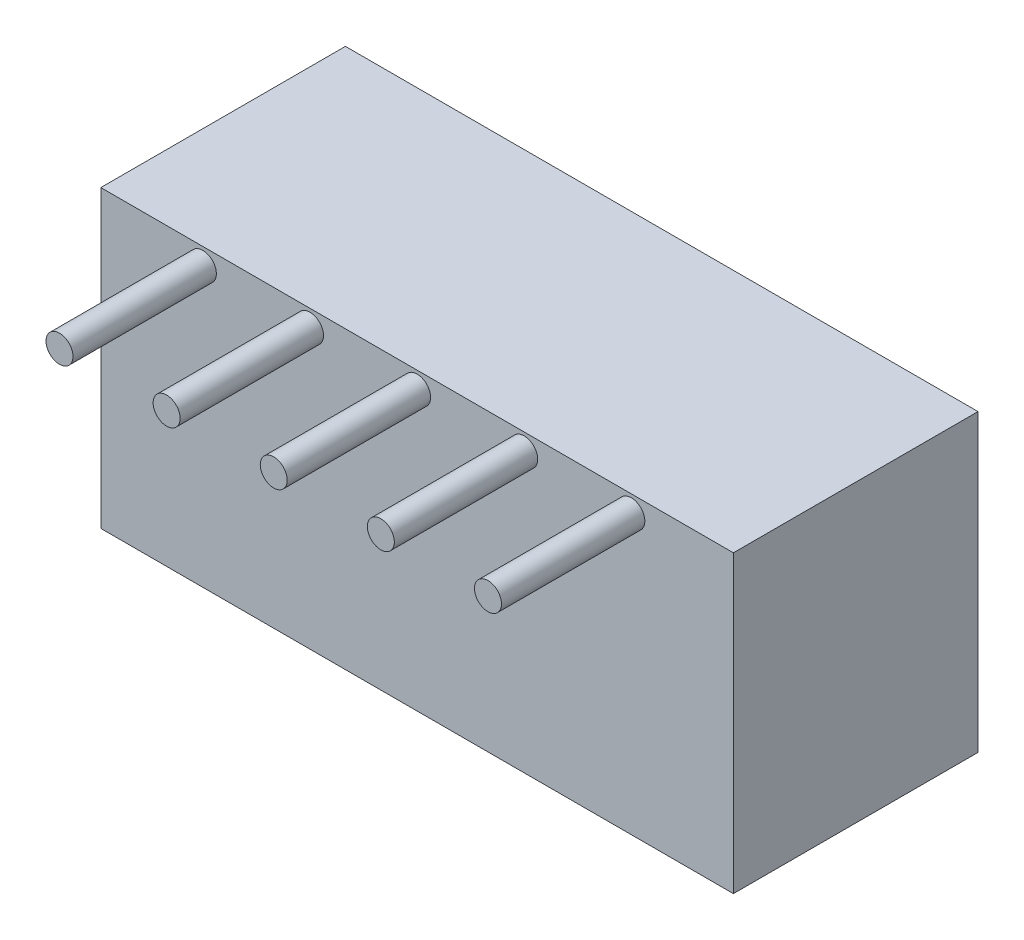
ISO-10303-21;
HEADER;
FILE_DESCRIPTION(('STEP AP214'),'2;1');
FILE_NAME('part.step','',(''),(''),'','','');
FILE_SCHEMA(('AUTOMOTIVE_DESIGN { 1 0 10303 214 1 1 1 1 }'));
ENDSEC;
DATA;
#1=APPLICATION_CONTEXT('core data for automotive mechanical design processes');
#2=APPLICATION_PROTOCOL_DEFINITION('international standard','automotive_design',2000,#1);
#3=PRODUCT_CONTEXT('',#1,'mechanical');
#4=PRODUCT('Part','Part','',(#3));
#5=PRODUCT_RELATED_PRODUCT_CATEGORY('part','',(#4));
#6=PRODUCT_DEFINITION_FORMATION('','',#4);
#7=PRODUCT_DEFINITION_CONTEXT('part definition',#1,'design');
#8=PRODUCT_DEFINITION('design','',#6,#7);
#9=PRODUCT_DEFINITION_SHAPE('','',#8);
#10=(LENGTH_UNIT() NAMED_UNIT(*) SI_UNIT(.MILLI.,.METRE.));
#11=(NAMED_UNIT(*) PLANE_ANGLE_UNIT() SI_UNIT($,.RADIAN.));
#12=(NAMED_UNIT(*) SI_UNIT($,.STERADIAN.) SOLID_ANGLE_UNIT());
#13=UNCERTAINTY_MEASURE_WITH_UNIT(LENGTH_MEASURE(1.E-05),#10,'distance_accuracy_value','');
#14=(GEOMETRIC_REPRESENTATION_CONTEXT(3) GLOBAL_UNCERTAINTY_ASSIGNED_CONTEXT((#13)) GLOBAL_UNIT_ASSIGNED_CONTEXT((#10,
#11,#12)) REPRESENTATION_CONTEXT('',''));
#15=CARTESIAN_POINT('',(0.,0.,0.));
#16=DIRECTION('',(0.,0.,1.));
#17=DIRECTION('',(1.,0.,0.));
#18=AXIS2_PLACEMENT_3D('',#15,#16,#17);
#19=CARTESIAN_POINT('',(0.,0.,5.8));
#20=DIRECTION('',(0.,1.,0.));
#21=DIRECTION('',(0.,0.,1.));
#22=AXIS2_PLACEMENT_3D('',#19,#20,#21);
#23=PLANE('',#22);
#24=DIRECTION('',(1.,0.,0.));
#25=VECTOR('',#24,1.);
#26=CARTESIAN_POINT('',(0.,0.,0.));
#27=LINE('',#26,#25);
#28=CARTESIAN_POINT('',(0.,0.,0.));
#29=VERTEX_POINT('',#28);
#30=CARTESIAN_POINT('',(15.,0.,0.));
#31=VERTEX_POINT('',#30);
#32=EDGE_CURVE('E181',#29,#31,#27,.T.);
#33=ORIENTED_EDGE('',*,*,#32,.T.);
#34=DIRECTION('',(0.,0.,-1.));
#35=VECTOR('',#34,1.);
#36=CARTESIAN_POINT('',(15.,0.,5.8));
#37=LINE('',#36,#35);
#38=CARTESIAN_POINT('',(15.,0.,5.8));
#39=VERTEX_POINT('',#38);
#40=EDGE_CURVE('E189',#39,#31,#37,.T.);
#41=ORIENTED_EDGE('',*,*,#40,.F.);
#42=DIRECTION('',(1.,0.,0.));
#43=VECTOR('',#42,1.);
#44=CARTESIAN_POINT('',(0.,0.,5.8));
#45=LINE('',#44,#43);
#46=CARTESIAN_POINT('',(0.,0.,5.8));
#47=VERTEX_POINT('',#46);
#48=EDGE_CURVE('E90',#47,#39,#45,.T.);
#49=ORIENTED_EDGE('',*,*,#48,.F.);
#50=DIRECTION('',(0.,0.,-1.));
#51=VECTOR('',#50,1.);
#52=CARTESIAN_POINT('',(0.,0.,5.8));
#53=LINE('',#52,#51);
#54=EDGE_CURVE('E192',#47,#29,#53,.T.);
#55=ORIENTED_EDGE('',*,*,#54,.T.);
#56=EDGE_LOOP('',(#33,#41,#49,#55));
#57=FACE_BOUND('',#56,.T.);
#58=DIRECTION('',(1.,0.,0.));
#59=VECTOR('',#58,1.);
#60=CARTESIAN_POINT('',(0.,0.,0.4));
#61=LINE('',#60,#59);
#62=CARTESIAN_POINT('',(0.4,0.,0.4));
#63=VERTEX_POINT('',#62);
#64=CARTESIAN_POINT('',(14.6,0.,0.4));
#65=VERTEX_POINT('',#64);
#66=EDGE_CURVE('E134',#63,#65,#61,.T.);
#67=ORIENTED_EDGE('',*,*,#66,.F.);
#68=DIRECTION('',(0.,0.,-1.));
#69=VECTOR('',#68,1.);
#70=CARTESIAN_POINT('',(0.4,0.,5.8));
#71=LINE('',#70,#69);
#72=CARTESIAN_POINT('',(0.4,0.,5.4));
#73=VERTEX_POINT('',#72);
#74=EDGE_CURVE('E133',#73,#63,#71,.T.);
#75=ORIENTED_EDGE('',*,*,#74,.F.);
#76=DIRECTION('',(1.,0.,0.));
#77=VECTOR('',#76,1.);
#78=CARTESIAN_POINT('',(0.,0.,5.4));
#79=LINE('',#78,#77);
#80=CARTESIAN_POINT('',(14.6,0.,5.4));
#81=VERTEX_POINT('',#80);
#82=EDGE_CURVE('E143',#73,#81,#79,.T.);
#83=ORIENTED_EDGE('',*,*,#82,.T.);
#84=DIRECTION('',(0.,0.,-1.));
#85=VECTOR('',#84,1.);
#86=CARTESIAN_POINT('',(14.6,0.,5.8));
#87=LINE('',#86,#85);
#88=EDGE_CURVE('E148',#81,#65,#87,.T.);
#89=ORIENTED_EDGE('',*,*,#88,.T.);
#90=EDGE_LOOP('',(#67,#75,#83,#89));
#91=FACE_BOUND('',#90,.T.);
#92=ADVANCED_FACE('F37',(#57,#91),#23,.F.);
#93=CARTESIAN_POINT('',(0.,0.,5.8));
#94=DIRECTION('',(1.,0.,0.));
#95=DIRECTION('',(0.,0.,-1.));
#96=AXIS2_PLACEMENT_3D('',#93,#94,#95);
#97=PLANE('',#96);
#98=DIRECTION('',(0.,-1.,0.));
#99=VECTOR('',#98,1.);
#100=CARTESIAN_POINT('',(0.,0.,0.));
#101=LINE('',#100,#99);
#102=CARTESIAN_POINT('',(0.,7.,0.));
#103=VERTEX_POINT('',#102);
#104=EDGE_CURVE('E171',#103,#29,#101,.T.);
#105=ORIENTED_EDGE('',*,*,#104,.T.);
#106=ORIENTED_EDGE('',*,*,#54,.F.);
#107=DIRECTION('',(0.,-1.,0.));
#108=VECTOR('',#107,1.);
#109=CARTESIAN_POINT('',(0.,0.,5.8));
#110=LINE('',#109,#108);
#111=CARTESIAN_POINT('',(0.,7.,5.8));
#112=VERTEX_POINT('',#111);
#113=EDGE_CURVE('E172',#112,#47,#110,.T.);
#114=ORIENTED_EDGE('',*,*,#113,.F.);
#115=DIRECTION('',(0.,0.,-1.));
#116=VECTOR('',#115,1.);
#117=CARTESIAN_POINT('',(0.,7.,5.8));
#118=LINE('',#117,#116);
#119=EDGE_CURVE('E178',#112,#103,#118,.T.);
#120=ORIENTED_EDGE('',*,*,#119,.T.);
#121=EDGE_LOOP('',(#105,#106,#114,#120));
#122=FACE_BOUND('',#121,.T.);
#123=ADVANCED_FACE('F39',(#122),#97,.F.);
#124=CARTESIAN_POINT('',(15.,0.,5.8));
#125=DIRECTION('',(-1.,0.,0.));
#126=DIRECTION('',(0.,0.,1.));
#127=AXIS2_PLACEMENT_3D('',#124,#125,#126);
#128=PLANE('',#127);
#129=DIRECTION('',(0.,1.,0.));
#130=VECTOR('',#129,1.);
#131=CARTESIAN_POINT('',(15.,0.,0.));
#132=LINE('',#131,#130);
#133=CARTESIAN_POINT('',(15.,7.,0.));
#134=VERTEX_POINT('',#133);
#135=EDGE_CURVE('E183',#31,#134,#132,.T.);
#136=ORIENTED_EDGE('',*,*,#135,.T.);
#137=DIRECTION('',(0.,0.,-1.));
#138=VECTOR('',#137,1.);
#139=CARTESIAN_POINT('',(15.,7.,5.8));
#140=LINE('',#139,#138);
#141=CARTESIAN_POINT('',(15.,7.,5.8));
#142=VERTEX_POINT('',#141);
#143=EDGE_CURVE('E187',#142,#134,#140,.T.);
#144=ORIENTED_EDGE('',*,*,#143,.F.);
#145=DIRECTION('',(0.,1.,0.));
#146=VECTOR('',#145,1.);
#147=CARTESIAN_POINT('',(15.,0.,5.8));
#148=LINE('',#147,#146);
#149=EDGE_CURVE('E175',#39,#142,#148,.T.);
#150=ORIENTED_EDGE('',*,*,#149,.F.);
#151=ORIENTED_EDGE('',*,*,#40,.T.);
#152=EDGE_LOOP('',(#136,#144,#150,#151));
#153=FACE_BOUND('',#152,.T.);
#154=ADVANCED_FACE('F255',(#153),#128,.F.);
#155=CARTESIAN_POINT('',(0.,7.,5.8));
#156=DIRECTION('',(0.,-1.,0.));
#157=DIRECTION('',(0.,0.,-1.));
#158=AXIS2_PLACEMENT_3D('',#155,#156,#157);
#159=PLANE('',#158);
#160=DIRECTION('',(-1.,0.,0.));
#161=VECTOR('',#160,1.);
#162=CARTESIAN_POINT('',(0.,7.,0.));
#163=LINE('',#162,#161);
#164=EDGE_CURVE('E82',#134,#103,#163,.T.);
#165=ORIENTED_EDGE('',*,*,#164,.T.);
#166=ORIENTED_EDGE('',*,*,#119,.F.);
#167=DIRECTION('',(-1.,0.,0.));
#168=VECTOR('',#167,1.);
#169=CARTESIAN_POINT('',(0.,7.,5.8));
#170=LINE('',#169,#168);
#171=EDGE_CURVE('E61',#142,#112,#170,.T.);
#172=ORIENTED_EDGE('',*,*,#171,.F.);
#173=ORIENTED_EDGE('',*,*,#143,.T.);
#174=EDGE_LOOP('',(#165,#166,#172,#173));
#175=FACE_BOUND('',#174,.T.);
#176=ADVANCED_FACE('F261',(#175),#159,.F.);
#177=CARTESIAN_POINT('',(0.,0.,5.8));
#178=DIRECTION('',(0.,0.,-1.));
#179=DIRECTION('',(-1.,0.,0.));
#180=AXIS2_PLACEMENT_3D('',#177,#178,#179);
#181=PLANE('',#180);
#182=CARTESIAN_POINT('',(12.58,6.6,5.8));
#183=DIRECTION('',(0.,0.,-1.));
#184=DIRECTION('',(-1.,0.,0.));
#185=AXIS2_PLACEMENT_3D('',#182,#183,#184);
#186=CIRCLE('',#185,0.32);
#187=CARTESIAN_POINT('',(12.26,6.6,5.8));
#188=VERTEX_POINT('',#187);
#189=EDGE_CURVE('E206',#188,#188,#186,.F.);
#190=ORIENTED_EDGE('',*,*,#189,.F.);
#191=EDGE_LOOP('',(#190));
#192=FACE_BOUND('',#191,.T.);
#193=CARTESIAN_POINT('',(10.04,6.6,5.8));
#194=DIRECTION('',(0.,0.,-1.));
#195=DIRECTION('',(-1.,0.,0.));
#196=AXIS2_PLACEMENT_3D('',#193,#194,#195);
#197=CIRCLE('',#196,0.32);
#198=CARTESIAN_POINT('',(9.72,6.6,5.8));
#199=VERTEX_POINT('',#198);
#200=EDGE_CURVE('E203',#199,#199,#197,.F.);
#201=ORIENTED_EDGE('',*,*,#200,.F.);
#202=EDGE_LOOP('',(#201));
#203=FACE_BOUND('',#202,.T.);
#204=CARTESIAN_POINT('',(7.5,6.6,5.8));
#205=DIRECTION('',(0.,0.,-1.));
#206=DIRECTION('',(-1.,0.,0.));
#207=AXIS2_PLACEMENT_3D('',#204,#205,#206);
#208=CIRCLE('',#207,0.319999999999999);
#209=CARTESIAN_POINT('',(7.18,6.6,5.8));
#210=VERTEX_POINT('',#209);
#211=EDGE_CURVE('E200',#210,#210,#208,.F.);
#212=ORIENTED_EDGE('',*,*,#211,.F.);
#213=EDGE_LOOP('',(#212));
#214=FACE_BOUND('',#213,.T.);
#215=CARTESIAN_POINT('',(4.96,6.6,5.8));
#216=DIRECTION('',(0.,0.,-1.));
#217=DIRECTION('',(-1.,0.,0.));
#218=AXIS2_PLACEMENT_3D('',#215,#216,#217);
#219=CIRCLE('',#218,0.319999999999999);
#220=CARTESIAN_POINT('',(4.64,6.6,5.8));
#221=VERTEX_POINT('',#220);
#222=EDGE_CURVE('E197',#221,#221,#219,.F.);
#223=ORIENTED_EDGE('',*,*,#222,.F.);
#224=EDGE_LOOP('',(#223));
#225=FACE_BOUND('',#224,.T.);
#226=CARTESIAN_POINT('',(2.42,6.6,5.8));
#227=DIRECTION('',(0.,0.,-1.));
#228=DIRECTION('',(-1.,0.,0.));
#229=AXIS2_PLACEMENT_3D('',#226,#227,#228);
#230=CIRCLE('',#229,0.32);
#231=CARTESIAN_POINT('',(2.1,6.6,5.8));
#232=VERTEX_POINT('',#231);
#233=EDGE_CURVE('E194',#232,#232,#230,.F.);
#234=ORIENTED_EDGE('',*,*,#233,.F.);
#235=EDGE_LOOP('',(#234));
#236=FACE_BOUND('',#235,.T.);
#237=ORIENTED_EDGE('',*,*,#113,.T.);
#238=ORIENTED_EDGE('',*,*,#48,.T.);
#239=ORIENTED_EDGE('',*,*,#149,.T.);
#240=ORIENTED_EDGE('',*,*,#171,.T.);
#241=EDGE_LOOP('',(#237,#238,#239,#240));
#242=FACE_BOUND('',#241,.T.);
#243=ADVANCED_FACE('F265',(#192,#203,#214,#225,#236,#242),#181,.F.);
#244=CARTESIAN_POINT('',(0.,0.,0.));
#245=DIRECTION('',(0.,0.,-1.));
#246=DIRECTION('',(-1.,0.,0.));
#247=AXIS2_PLACEMENT_3D('',#244,#245,#246);
#248=PLANE('',#247);
#249=ORIENTED_EDGE('',*,*,#104,.F.);
#250=ORIENTED_EDGE('',*,*,#164,.F.);
#251=ORIENTED_EDGE('',*,*,#135,.F.);
#252=ORIENTED_EDGE('',*,*,#32,.F.);
#253=EDGE_LOOP('',(#249,#250,#251,#252));
#254=FACE_BOUND('',#253,.T.);
#255=ADVANCED_FACE('F266',(#254),#248,.T.);
#256=CARTESIAN_POINT('',(2.42,6.6,9.2));
#257=DIRECTION('',(0.,0.,-1.));
#258=DIRECTION('',(-1.,0.,0.));
#259=AXIS2_PLACEMENT_3D('',#256,#257,#258);
#260=CYLINDRICAL_SURFACE('',#259,0.32);
#261=CARTESIAN_POINT('',(2.42,6.6,9.2));
#262=DIRECTION('',(0.,0.,1.));
#263=DIRECTION('',(1.,0.,0.));
#264=AXIS2_PLACEMENT_3D('',#261,#262,#263);
#265=CIRCLE('',#264,0.32);
#266=CARTESIAN_POINT('',(2.74,6.6,9.2));
#267=VERTEX_POINT('',#266);
#268=EDGE_CURVE('E168',#267,#267,#265,.T.);
#269=ORIENTED_EDGE('',*,*,#268,.F.);
#270=EDGE_LOOP('',(#269));
#271=FACE_BOUND('',#270,.T.);
#272=ORIENTED_EDGE('',*,*,#233,.T.);
#273=EDGE_LOOP('',(#272));
#274=FACE_BOUND('',#273,.T.);
#275=ADVANCED_FACE('F269',(#271,#274),#260,.T.);
#276=CARTESIAN_POINT('',(2.42,6.6,9.2));
#277=DIRECTION('',(0.,0.,1.));
#278=DIRECTION('',(1.,0.,0.));
#279=AXIS2_PLACEMENT_3D('',#276,#277,#278);
#280=PLANE('',#279);
#281=ORIENTED_EDGE('',*,*,#268,.T.);
#282=EDGE_LOOP('',(#281));
#283=FACE_BOUND('',#282,.T.);
#284=ADVANCED_FACE('F276',(#283),#280,.T.);
#285=CARTESIAN_POINT('',(4.96,6.6,9.2));
#286=DIRECTION('',(0.,0.,-1.));
#287=DIRECTION('',(-1.,0.,0.));
#288=AXIS2_PLACEMENT_3D('',#285,#286,#287);
#289=CYLINDRICAL_SURFACE('',#288,0.319999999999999);
#290=CARTESIAN_POINT('',(4.96,6.6,9.2));
#291=DIRECTION('',(0.,0.,1.));
#292=DIRECTION('',(1.,0.,0.));
#293=AXIS2_PLACEMENT_3D('',#290,#291,#292);
#294=CIRCLE('',#293,0.319999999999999);
#295=CARTESIAN_POINT('',(5.28,6.6,9.2));
#296=VERTEX_POINT('',#295);
#297=EDGE_CURVE('E165',#296,#296,#294,.T.);
#298=ORIENTED_EDGE('',*,*,#297,.F.);
#299=EDGE_LOOP('',(#298));
#300=FACE_BOUND('',#299,.T.);
#301=ORIENTED_EDGE('',*,*,#222,.T.);
#302=EDGE_LOOP('',(#301));
#303=FACE_BOUND('',#302,.T.);
#304=ADVANCED_FACE('F280',(#300,#303),#289,.T.);
#305=CARTESIAN_POINT('',(4.96,6.6,9.2));
#306=DIRECTION('',(0.,0.,1.));
#307=DIRECTION('',(1.,0.,0.));
#308=AXIS2_PLACEMENT_3D('',#305,#306,#307);
#309=PLANE('',#308);
#310=ORIENTED_EDGE('',*,*,#297,.T.);
#311=EDGE_LOOP('',(#310));
#312=FACE_BOUND('',#311,.T.);
#313=ADVANCED_FACE('F284',(#312),#309,.T.);
#314=CARTESIAN_POINT('',(7.5,6.6,9.2));
#315=DIRECTION('',(0.,0.,-1.));
#316=DIRECTION('',(-1.,0.,0.));
#317=AXIS2_PLACEMENT_3D('',#314,#315,#316);
#318=CYLINDRICAL_SURFACE('',#317,0.319999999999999);
#319=CARTESIAN_POINT('',(7.5,6.6,9.2));
#320=DIRECTION('',(0.,0.,1.));
#321=DIRECTION('',(1.,0.,0.));
#322=AXIS2_PLACEMENT_3D('',#319,#320,#321);
#323=CIRCLE('',#322,0.319999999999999);
#324=CARTESIAN_POINT('',(7.82,6.6,9.2));
#325=VERTEX_POINT('',#324);
#326=EDGE_CURVE('E162',#325,#325,#323,.T.);
#327=ORIENTED_EDGE('',*,*,#326,.F.);
#328=EDGE_LOOP('',(#327));
#329=FACE_BOUND('',#328,.T.);
#330=ORIENTED_EDGE('',*,*,#211,.T.);
#331=EDGE_LOOP('',(#330));
#332=FACE_BOUND('',#331,.T.);
#333=ADVANCED_FACE('F288',(#329,#332),#318,.T.);
#334=CARTESIAN_POINT('',(7.5,6.6,9.2));
#335=DIRECTION('',(0.,0.,1.));
#336=DIRECTION('',(1.,0.,0.));
#337=AXIS2_PLACEMENT_3D('',#334,#335,#336);
#338=PLANE('',#337);
#339=ORIENTED_EDGE('',*,*,#326,.T.);
#340=EDGE_LOOP('',(#339));
#341=FACE_BOUND('',#340,.T.);
#342=ADVANCED_FACE('F292',(#341),#338,.T.);
#343=CARTESIAN_POINT('',(10.04,6.6,9.2));
#344=DIRECTION('',(0.,0.,-1.));
#345=DIRECTION('',(-1.,0.,0.));
#346=AXIS2_PLACEMENT_3D('',#343,#344,#345);
#347=CYLINDRICAL_SURFACE('',#346,0.32);
#348=CARTESIAN_POINT('',(10.04,6.6,9.2));
#349=DIRECTION('',(0.,0.,1.));
#350=DIRECTION('',(1.,0.,0.));
#351=AXIS2_PLACEMENT_3D('',#348,#349,#350);
#352=CIRCLE('',#351,0.32);
#353=CARTESIAN_POINT('',(10.36,6.6,9.2));
#354=VERTEX_POINT('',#353);
#355=EDGE_CURVE('E159',#354,#354,#352,.T.);
#356=ORIENTED_EDGE('',*,*,#355,.F.);
#357=EDGE_LOOP('',(#356));
#358=FACE_BOUND('',#357,.T.);
#359=ORIENTED_EDGE('',*,*,#200,.T.);
#360=EDGE_LOOP('',(#359));
#361=FACE_BOUND('',#360,.T.);
#362=ADVANCED_FACE('F296',(#358,#361),#347,.T.);
#363=CARTESIAN_POINT('',(10.04,6.6,9.2));
#364=DIRECTION('',(0.,0.,1.));
#365=DIRECTION('',(1.,0.,0.));
#366=AXIS2_PLACEMENT_3D('',#363,#364,#365);
#367=PLANE('',#366);
#368=ORIENTED_EDGE('',*,*,#355,.T.);
#369=EDGE_LOOP('',(#368));
#370=FACE_BOUND('',#369,.T.);
#371=ADVANCED_FACE('F300',(#370),#367,.T.);
#372=CARTESIAN_POINT('',(12.58,6.6,9.2));
#373=DIRECTION('',(0.,0.,-1.));
#374=DIRECTION('',(-1.,0.,0.));
#375=AXIS2_PLACEMENT_3D('',#372,#373,#374);
#376=CYLINDRICAL_SURFACE('',#375,0.32);
#377=CARTESIAN_POINT('',(12.58,6.6,9.2));
#378=DIRECTION('',(0.,0.,1.));
#379=DIRECTION('',(1.,0.,0.));
#380=AXIS2_PLACEMENT_3D('',#377,#378,#379);
#381=CIRCLE('',#380,0.32);
#382=CARTESIAN_POINT('',(12.9,6.6,9.2));
#383=VERTEX_POINT('',#382);
#384=EDGE_CURVE('E151',#383,#383,#381,.T.);
#385=ORIENTED_EDGE('',*,*,#384,.F.);
#386=EDGE_LOOP('',(#385));
#387=FACE_BOUND('',#386,.T.);
#388=ORIENTED_EDGE('',*,*,#189,.T.);
#389=EDGE_LOOP('',(#388));
#390=FACE_BOUND('',#389,.T.);
#391=ADVANCED_FACE('F304',(#387,#390),#376,.T.);
#392=CARTESIAN_POINT('',(12.58,6.6,9.2));
#393=DIRECTION('',(0.,0.,1.));
#394=DIRECTION('',(1.,0.,0.));
#395=AXIS2_PLACEMENT_3D('',#392,#393,#394);
#396=PLANE('',#395);
#397=ORIENTED_EDGE('',*,*,#384,.T.);
#398=EDGE_LOOP('',(#397));
#399=FACE_BOUND('',#398,.T.);
#400=ADVANCED_FACE('F308',(#399),#396,.T.);
#401=CARTESIAN_POINT('',(0.4,0.,5.8));
#402=DIRECTION('',(1.,0.,0.));
#403=DIRECTION('',(0.,0.,-1.));
#404=AXIS2_PLACEMENT_3D('',#401,#402,#403);
#405=PLANE('',#404);
#406=DIRECTION('',(0.,-1.,0.));
#407=VECTOR('',#406,1.);
#408=CARTESIAN_POINT('',(0.4,0.,0.4));
#409=LINE('',#408,#407);
#410=CARTESIAN_POINT('',(0.4,6.6,0.4));
#411=VERTEX_POINT('',#410);
#412=EDGE_CURVE('E117',#411,#63,#409,.T.);
#413=ORIENTED_EDGE('',*,*,#412,.F.);
#414=DIRECTION('',(0.,0.,-1.));
#415=VECTOR('',#414,1.);
#416=CARTESIAN_POINT('',(0.4,6.6,5.8));
#417=LINE('',#416,#415);
#418=CARTESIAN_POINT('',(0.4,6.6,5.4));
#419=VERTEX_POINT('',#418);
#420=EDGE_CURVE('E125',#419,#411,#417,.T.);
#421=ORIENTED_EDGE('',*,*,#420,.F.);
#422=DIRECTION('',(0.,-1.,0.));
#423=VECTOR('',#422,1.);
#424=CARTESIAN_POINT('',(0.4,0.,5.4));
#425=LINE('',#424,#423);
#426=EDGE_CURVE('E52',#419,#73,#425,.T.);
#427=ORIENTED_EDGE('',*,*,#426,.T.);
#428=ORIENTED_EDGE('',*,*,#74,.T.);
#429=EDGE_LOOP('',(#413,#421,#427,#428));
#430=FACE_BOUND('',#429,.T.);
#431=ADVANCED_FACE('F131',(#430),#405,.T.);
#432=CARTESIAN_POINT('',(14.6,0.,5.8));
#433=DIRECTION('',(-1.,0.,0.));
#434=DIRECTION('',(0.,0.,1.));
#435=AXIS2_PLACEMENT_3D('',#432,#433,#434);
#436=PLANE('',#435);
#437=DIRECTION('',(0.,1.,0.));
#438=VECTOR('',#437,1.);
#439=CARTESIAN_POINT('',(14.6,0.,0.4));
#440=LINE('',#439,#438);
#441=CARTESIAN_POINT('',(14.6,6.6,0.4));
#442=VERTEX_POINT('',#441);
#443=EDGE_CURVE('E120',#65,#442,#440,.T.);
#444=ORIENTED_EDGE('',*,*,#443,.F.);
#445=ORIENTED_EDGE('',*,*,#88,.F.);
#446=DIRECTION('',(0.,1.,0.));
#447=VECTOR('',#446,1.);
#448=CARTESIAN_POINT('',(14.6,0.,5.4));
#449=LINE('',#448,#447);
#450=CARTESIAN_POINT('',(14.6,6.6,5.4));
#451=VERTEX_POINT('',#450);
#452=EDGE_CURVE('E146',#81,#451,#449,.T.);
#453=ORIENTED_EDGE('',*,*,#452,.T.);
#454=DIRECTION('',(0.,0.,-1.));
#455=VECTOR('',#454,1.);
#456=CARTESIAN_POINT('',(14.6,6.6,5.8));
#457=LINE('',#456,#455);
#458=EDGE_CURVE('E129',#451,#442,#457,.T.);
#459=ORIENTED_EDGE('',*,*,#458,.T.);
#460=EDGE_LOOP('',(#444,#445,#453,#459));
#461=FACE_BOUND('',#460,.T.);
#462=ADVANCED_FACE('F226',(#461),#436,.T.);
#463=CARTESIAN_POINT('',(0.,6.6,5.8));
#464=DIRECTION('',(0.,-1.,0.));
#465=DIRECTION('',(0.,0.,-1.));
#466=AXIS2_PLACEMENT_3D('',#463,#464,#465);
#467=PLANE('',#466);
#468=CARTESIAN_POINT('',(12.58,6.6,2.9));
#469=DIRECTION('',(0.,-1.,0.));
#470=DIRECTION('',(0.,0.,-1.));
#471=AXIS2_PLACEMENT_3D('',#468,#469,#470);
#472=CIRCLE('',#471,0.32);
#473=CARTESIAN_POINT('',(12.58,6.6,2.58));
#474=VERTEX_POINT('',#473);
#475=EDGE_CURVE('E11',#474,#474,#472,.T.);
#476=ORIENTED_EDGE('',*,*,#475,.F.);
#477=EDGE_LOOP('',(#476));
#478=FACE_BOUND('',#477,.T.);
#479=CARTESIAN_POINT('',(10.04,6.6,2.9));
#480=DIRECTION('',(0.,-1.,0.));
#481=DIRECTION('',(0.,0.,-1.));
#482=AXIS2_PLACEMENT_3D('',#479,#480,#481);
#483=CIRCLE('',#482,0.32);
#484=CARTESIAN_POINT('',(10.04,6.6,2.58));
#485=VERTEX_POINT('',#484);
#486=EDGE_CURVE('E45',#485,#485,#483,.T.);
#487=ORIENTED_EDGE('',*,*,#486,.F.);
#488=EDGE_LOOP('',(#487));
#489=FACE_BOUND('',#488,.T.);
#490=CARTESIAN_POINT('',(7.5,6.6,2.9));
#491=DIRECTION('',(0.,-1.,0.));
#492=DIRECTION('',(0.,0.,-1.));
#493=AXIS2_PLACEMENT_3D('',#490,#491,#492);
#494=CIRCLE('',#493,0.32);
#495=CARTESIAN_POINT('',(7.5,6.6,2.58));
#496=VERTEX_POINT('',#495);
#497=EDGE_CURVE('E215',#496,#496,#494,.T.);
#498=ORIENTED_EDGE('',*,*,#497,.F.);
#499=EDGE_LOOP('',(#498));
#500=FACE_BOUND('',#499,.T.);
#501=CARTESIAN_POINT('',(4.96,6.6,2.9));
#502=DIRECTION('',(0.,-1.,0.));
#503=DIRECTION('',(0.,0.,-1.));
#504=AXIS2_PLACEMENT_3D('',#501,#502,#503);
#505=CIRCLE('',#504,0.32);
#506=CARTESIAN_POINT('',(4.96,6.6,2.58));
#507=VERTEX_POINT('',#506);
#508=EDGE_CURVE('E212',#507,#507,#505,.T.);
#509=ORIENTED_EDGE('',*,*,#508,.F.);
#510=EDGE_LOOP('',(#509));
#511=FACE_BOUND('',#510,.T.);
#512=CARTESIAN_POINT('',(2.42,6.6,2.9));
#513=DIRECTION('',(0.,-1.,0.));
#514=DIRECTION('',(0.,0.,-1.));
#515=AXIS2_PLACEMENT_3D('',#512,#513,#514);
#516=CIRCLE('',#515,0.32);
#517=CARTESIAN_POINT('',(2.42,6.6,2.58));
#518=VERTEX_POINT('',#517);
#519=EDGE_CURVE('E209',#518,#518,#516,.T.);
#520=ORIENTED_EDGE('',*,*,#519,.F.);
#521=EDGE_LOOP('',(#520));
#522=FACE_BOUND('',#521,.T.);
#523=DIRECTION('',(-1.,0.,0.));
#524=VECTOR('',#523,1.);
#525=CARTESIAN_POINT('',(0.,6.6,0.4));
#526=LINE('',#525,#524);
#527=EDGE_CURVE('E113',#442,#411,#526,.T.);
#528=ORIENTED_EDGE('',*,*,#527,.F.);
#529=ORIENTED_EDGE('',*,*,#458,.F.);
#530=DIRECTION('',(-1.,0.,0.));
#531=VECTOR('',#530,1.);
#532=CARTESIAN_POINT('',(0.,6.6,5.4));
#533=LINE('',#532,#531);
#534=EDGE_CURVE('E128',#451,#419,#533,.T.);
#535=ORIENTED_EDGE('',*,*,#534,.T.);
#536=ORIENTED_EDGE('',*,*,#420,.T.);
#537=EDGE_LOOP('',(#528,#529,#535,#536));
#538=FACE_BOUND('',#537,.T.);
#539=ADVANCED_FACE('F126',(#478,#489,#500,#511,#522,#538),#467,.T.);
#540=CARTESIAN_POINT('',(0.,0.,5.4));
#541=DIRECTION('',(0.,0.,-1.));
#542=DIRECTION('',(-1.,0.,0.));
#543=AXIS2_PLACEMENT_3D('',#540,#541,#542);
#544=PLANE('',#543);
#545=ORIENTED_EDGE('',*,*,#426,.F.);
#546=ORIENTED_EDGE('',*,*,#534,.F.);
#547=ORIENTED_EDGE('',*,*,#452,.F.);
#548=ORIENTED_EDGE('',*,*,#82,.F.);
#549=EDGE_LOOP('',(#545,#546,#547,#548));
#550=FACE_BOUND('',#549,.T.);
#551=ADVANCED_FACE('F225',(#550),#544,.T.);
#552=CARTESIAN_POINT('',(0.,0.,0.4));
#553=DIRECTION('',(0.,0.,-1.));
#554=DIRECTION('',(-1.,0.,0.));
#555=AXIS2_PLACEMENT_3D('',#552,#553,#554);
#556=PLANE('',#555);
#557=ORIENTED_EDGE('',*,*,#412,.T.);
#558=ORIENTED_EDGE('',*,*,#66,.T.);
#559=ORIENTED_EDGE('',*,*,#443,.T.);
#560=ORIENTED_EDGE('',*,*,#527,.T.);
#561=EDGE_LOOP('',(#557,#558,#559,#560));
#562=FACE_BOUND('',#561,.T.);
#563=ADVANCED_FACE('F115',(#562),#556,.F.);
#564=CARTESIAN_POINT('',(2.42,0.999999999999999,2.9));
#565=DIRECTION('',(0.,1.,0.));
#566=DIRECTION('',(0.,0.,1.));
#567=AXIS2_PLACEMENT_3D('',#564,#565,#566);
#568=CYLINDRICAL_SURFACE('',#567,0.32);
#569=ORIENTED_EDGE('',*,*,#519,.T.);
#570=EDGE_LOOP('',(#569));
#571=FACE_BOUND('',#570,.T.);
#572=CARTESIAN_POINT('',(2.42,0.999999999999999,2.9));
#573=DIRECTION('',(0.,1.,0.));
#574=DIRECTION('',(0.,0.,1.));
#575=AXIS2_PLACEMENT_3D('',#572,#573,#574);
#576=CIRCLE('',#575,0.32);
#577=CARTESIAN_POINT('',(2.42,0.999999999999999,3.22));
#578=VERTEX_POINT('',#577);
#579=EDGE_CURVE('E135',#578,#578,#576,.T.);
#580=ORIENTED_EDGE('',*,*,#579,.T.);
#581=EDGE_LOOP('',(#580));
#582=FACE_BOUND('',#581,.T.);
#583=ADVANCED_FACE('F235',(#571,#582),#568,.T.);
#584=CARTESIAN_POINT('',(2.42,0.999999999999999,2.9));
#585=DIRECTION('',(0.,1.,0.));
#586=DIRECTION('',(0.,0.,1.));
#587=AXIS2_PLACEMENT_3D('',#584,#585,#586);
#588=PLANE('',#587);
#589=ORIENTED_EDGE('',*,*,#579,.F.);
#590=EDGE_LOOP('',(#589));
#591=FACE_BOUND('',#590,.T.);
#592=ADVANCED_FACE('F238',(#591),#588,.F.);
#593=CARTESIAN_POINT('',(4.96,0.999999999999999,2.9));
#594=DIRECTION('',(0.,1.,0.));
#595=DIRECTION('',(0.,0.,1.));
#596=AXIS2_PLACEMENT_3D('',#593,#594,#595);
#597=CYLINDRICAL_SURFACE('',#596,0.32);
#598=ORIENTED_EDGE('',*,*,#508,.T.);
#599=EDGE_LOOP('',(#598));
#600=FACE_BOUND('',#599,.T.);
#601=CARTESIAN_POINT('',(4.96,0.999999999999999,2.9));
#602=DIRECTION('',(0.,1.,0.));
#603=DIRECTION('',(0.,0.,1.));
#604=AXIS2_PLACEMENT_3D('',#601,#602,#603);
#605=CIRCLE('',#604,0.32);
#606=CARTESIAN_POINT('',(4.96,0.999999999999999,3.22));
#607=VERTEX_POINT('',#606);
#608=EDGE_CURVE('E139',#607,#607,#605,.T.);
#609=ORIENTED_EDGE('',*,*,#608,.T.);
#610=EDGE_LOOP('',(#609));
#611=FACE_BOUND('',#610,.T.);
#612=ADVANCED_FACE('F243',(#600,#611),#597,.T.);
#613=CARTESIAN_POINT('',(4.96,0.999999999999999,2.9));
#614=DIRECTION('',(0.,1.,0.));
#615=DIRECTION('',(0.,0.,1.));
#616=AXIS2_PLACEMENT_3D('',#613,#614,#615);
#617=PLANE('',#616);
#618=ORIENTED_EDGE('',*,*,#608,.F.);
#619=EDGE_LOOP('',(#618));
#620=FACE_BOUND('',#619,.T.);
#621=ADVANCED_FACE('F248',(#620),#617,.F.);
#622=CARTESIAN_POINT('',(7.5,0.999999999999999,2.9));
#623=DIRECTION('',(0.,1.,0.));
#624=DIRECTION('',(0.,0.,1.));
#625=AXIS2_PLACEMENT_3D('',#622,#623,#624);
#626=CYLINDRICAL_SURFACE('',#625,0.32);
#627=ORIENTED_EDGE('',*,*,#497,.T.);
#628=EDGE_LOOP('',(#627));
#629=FACE_BOUND('',#628,.T.);
#630=CARTESIAN_POINT('',(7.5,0.999999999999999,2.9));
#631=DIRECTION('',(0.,1.,0.));
#632=DIRECTION('',(0.,0.,1.));
#633=AXIS2_PLACEMENT_3D('',#630,#631,#632);
#634=CIRCLE('',#633,0.32);
#635=CARTESIAN_POINT('',(7.5,0.999999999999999,3.22));
#636=VERTEX_POINT('',#635);
#637=EDGE_CURVE('E436',#636,#636,#634,.T.);
#638=ORIENTED_EDGE('',*,*,#637,.T.);
#639=EDGE_LOOP('',(#638));
#640=FACE_BOUND('',#639,.T.);
#641=ADVANCED_FACE('F367',(#629,#640),#626,.T.);
#642=CARTESIAN_POINT('',(7.5,0.999999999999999,2.9));
#643=DIRECTION('',(0.,1.,0.));
#644=DIRECTION('',(0.,0.,1.));
#645=AXIS2_PLACEMENT_3D('',#642,#643,#644);
#646=PLANE('',#645);
#647=ORIENTED_EDGE('',*,*,#637,.F.);
#648=EDGE_LOOP('',(#647));
#649=FACE_BOUND('',#648,.T.);
#650=ADVANCED_FACE('F377',(#649),#646,.F.);
#651=CARTESIAN_POINT('',(10.04,0.999999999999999,2.9));
#652=DIRECTION('',(0.,1.,0.));
#653=DIRECTION('',(0.,0.,1.));
#654=AXIS2_PLACEMENT_3D('',#651,#652,#653);
#655=CYLINDRICAL_SURFACE('',#654,0.32);
#656=ORIENTED_EDGE('',*,*,#486,.T.);
#657=EDGE_LOOP('',(#656));
#658=FACE_BOUND('',#657,.T.);
#659=CARTESIAN_POINT('',(10.04,0.999999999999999,2.9));
#660=DIRECTION('',(0.,1.,0.));
#661=DIRECTION('',(0.,0.,1.));
#662=AXIS2_PLACEMENT_3D('',#659,#660,#661);
#663=CIRCLE('',#662,0.32);
#664=CARTESIAN_POINT('',(10.04,0.999999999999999,3.22));
#665=VERTEX_POINT('',#664);
#666=EDGE_CURVE('E433',#665,#665,#663,.T.);
#667=ORIENTED_EDGE('',*,*,#666,.T.);
#668=EDGE_LOOP('',(#667));
#669=FACE_BOUND('',#668,.T.);
#670=ADVANCED_FACE('F220',(#658,#669),#655,.T.);
#671=CARTESIAN_POINT('',(10.04,0.999999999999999,2.9));
#672=DIRECTION('',(0.,1.,0.));
#673=DIRECTION('',(0.,0.,1.));
#674=AXIS2_PLACEMENT_3D('',#671,#672,#673);
#675=PLANE('',#674);
#676=ORIENTED_EDGE('',*,*,#666,.F.);
#677=EDGE_LOOP('',(#676));
#678=FACE_BOUND('',#677,.T.);
#679=ADVANCED_FACE('F396',(#678),#675,.F.);
#680=CARTESIAN_POINT('',(12.58,0.999999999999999,2.9));
#681=DIRECTION('',(0.,1.,0.));
#682=DIRECTION('',(0.,0.,1.));
#683=AXIS2_PLACEMENT_3D('',#680,#681,#682);
#684=CYLINDRICAL_SURFACE('',#683,0.32);
#685=ORIENTED_EDGE('',*,*,#475,.T.);
#686=EDGE_LOOP('',(#685));
#687=FACE_BOUND('',#686,.T.);
#688=CARTESIAN_POINT('',(12.58,0.999999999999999,2.9));
#689=DIRECTION('',(0.,1.,0.));
#690=DIRECTION('',(0.,0.,1.));
#691=AXIS2_PLACEMENT_3D('',#688,#689,#690);
#692=CIRCLE('',#691,0.32);
#693=CARTESIAN_POINT('',(12.58,0.999999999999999,3.22));
#694=VERTEX_POINT('',#693);
#695=EDGE_CURVE('E431',#694,#694,#692,.T.);
#696=ORIENTED_EDGE('',*,*,#695,.T.);
#697=EDGE_LOOP('',(#696));
#698=FACE_BOUND('',#697,.T.);
#699=ADVANCED_FACE('F405',(#687,#698),#684,.T.);
#700=CARTESIAN_POINT('',(12.58,0.999999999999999,2.9));
#701=DIRECTION('',(0.,1.,0.));
#702=DIRECTION('',(0.,0.,1.));
#703=AXIS2_PLACEMENT_3D('',#700,#701,#702);
#704=PLANE('',#703);
#705=ORIENTED_EDGE('',*,*,#695,.F.);
#706=EDGE_LOOP('',(#705));
#707=FACE_BOUND('',#706,.T.);
#708=ADVANCED_FACE('F415',(#707),#704,.F.);
#709=CLOSED_SHELL('',(#92,#123,#154,#176,#243,#255,#275,#284,#304,#313,#333,#342,#362,#371,#391,
#400,#431,#462,#539,#551,#563,#583,#592,#612,#621,#641,#650,#670,#679,#699,#708));
#710=MANIFOLD_SOLID_BREP('B2',#709);
#711=ADVANCED_BREP_SHAPE_REPRESENTATION('',(#18,#710),#14);
#712=SHAPE_DEFINITION_REPRESENTATION(#9,#711);
ENDSEC;
END-ISO-10303-21;
